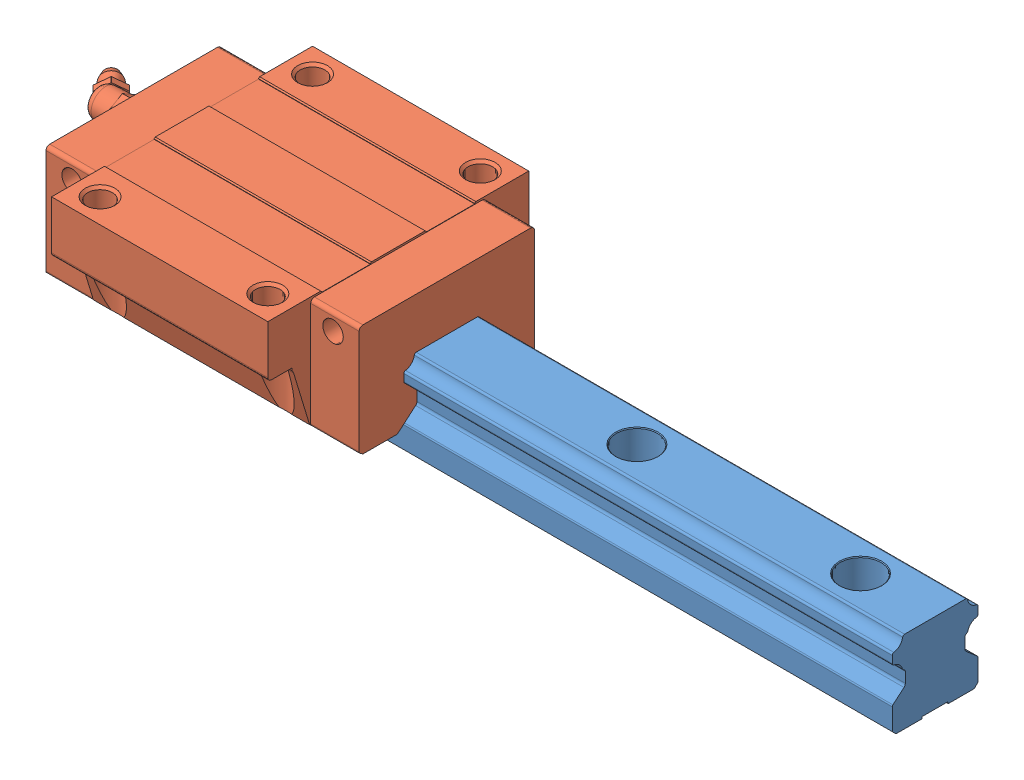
SolidWorks assembly HLW25CC.stp.sldasm, configuration 默认 (file format 13000). Lengths in mm.
Overall size (229.43 36 70).
2 component instances, 2 part files, 0 mates.
Components (placement in the parent):
- HLR25R220 E=20-1: HLR25R220 E=20.SLDPRT [默认] at origin size (220 22 23)
- HLW25CC-1: HLW25CC.SLDPRT [默认] at (5 5.5 0) size (98.43 30.5 70)
